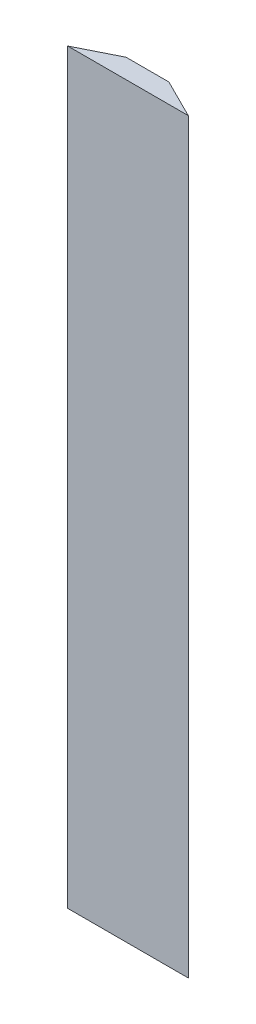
ISO-10303-21;
HEADER;
FILE_DESCRIPTION(('STEP AP214'),'2;1');
FILE_NAME('part.step','',(''),(''),'','','');
FILE_SCHEMA(('AUTOMOTIVE_DESIGN { 1 0 10303 214 1 1 1 1 }'));
ENDSEC;
DATA;
#1=APPLICATION_CONTEXT('core data for automotive mechanical design processes');
#2=APPLICATION_PROTOCOL_DEFINITION('international standard','automotive_design',2000,#1);
#3=PRODUCT_CONTEXT('',#1,'mechanical');
#4=PRODUCT('Part','Part','',(#3));
#5=PRODUCT_RELATED_PRODUCT_CATEGORY('part','',(#4));
#6=PRODUCT_DEFINITION_FORMATION('','',#4);
#7=PRODUCT_DEFINITION_CONTEXT('part definition',#1,'design');
#8=PRODUCT_DEFINITION('design','',#6,#7);
#9=PRODUCT_DEFINITION_SHAPE('','',#8);
#10=(LENGTH_UNIT() NAMED_UNIT(*) SI_UNIT(.MILLI.,.METRE.));
#11=(NAMED_UNIT(*) PLANE_ANGLE_UNIT() SI_UNIT($,.RADIAN.));
#12=(NAMED_UNIT(*) SI_UNIT($,.STERADIAN.) SOLID_ANGLE_UNIT());
#13=UNCERTAINTY_MEASURE_WITH_UNIT(LENGTH_MEASURE(1.E-05),#10,'distance_accuracy_value','');
#14=(GEOMETRIC_REPRESENTATION_CONTEXT(3) GLOBAL_UNCERTAINTY_ASSIGNED_CONTEXT((#13)) GLOBAL_UNIT_ASSIGNED_CONTEXT((#10,
#11,#12)) REPRESENTATION_CONTEXT('',''));
#15=CARTESIAN_POINT('',(0.,0.,0.));
#16=DIRECTION('',(0.,0.,1.));
#17=DIRECTION('',(1.,0.,0.));
#18=AXIS2_PLACEMENT_3D('',#15,#16,#17);
#19=CARTESIAN_POINT('',(98.425,1219.2,0.));
#20=DIRECTION('',(0.,0.,-1.));
#21=DIRECTION('',(-1.,0.,0.));
#22=AXIS2_PLACEMENT_3D('',#19,#20,#21);
#23=PLANE('',#22);
#24=DIRECTION('',(1.,0.,0.));
#25=VECTOR('',#24,1.);
#26=CARTESIAN_POINT('',(98.425,0.,0.));
#27=LINE('',#26,#25);
#28=CARTESIAN_POINT('',(-98.425,0.,0.));
#29=VERTEX_POINT('',#28);
#30=CARTESIAN_POINT('',(98.425,0.,0.));
#31=VERTEX_POINT('',#30);
#32=EDGE_CURVE('E102',#29,#31,#27,.T.);
#33=ORIENTED_EDGE('',*,*,#32,.T.);
#34=DIRECTION('',(0.,-1.,0.));
#35=VECTOR('',#34,1.);
#36=CARTESIAN_POINT('',(98.425,1219.2,0.));
#37=LINE('',#36,#35);
#38=CARTESIAN_POINT('',(98.425,1219.2,0.));
#39=VERTEX_POINT('',#38);
#40=EDGE_CURVE('E11',#39,#31,#37,.T.);
#41=ORIENTED_EDGE('',*,*,#40,.F.);
#42=DIRECTION('',(1.,0.,0.));
#43=VECTOR('',#42,1.);
#44=CARTESIAN_POINT('',(98.425,1219.2,0.));
#45=LINE('',#44,#43);
#46=CARTESIAN_POINT('',(-98.425,1219.2,0.));
#47=VERTEX_POINT('',#46);
#48=EDGE_CURVE('E89',#47,#39,#45,.T.);
#49=ORIENTED_EDGE('',*,*,#48,.F.);
#50=DIRECTION('',(0.,-1.,0.));
#51=VECTOR('',#50,1.);
#52=CARTESIAN_POINT('',(-98.425,1219.2,0.));
#53=LINE('',#52,#51);
#54=EDGE_CURVE('E98',#47,#29,#53,.T.);
#55=ORIENTED_EDGE('',*,*,#54,.T.);
#56=EDGE_LOOP('',(#33,#41,#49,#55));
#57=FACE_BOUND('',#56,.T.);
#58=ADVANCED_FACE('F38',(#57),#23,.F.);
#59=CARTESIAN_POINT('',(34.925,1219.2,-31.75));
#60=DIRECTION('',(-0.447213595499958,0.,0.894427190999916));
#61=DIRECTION('',(0.894427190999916,0.,0.447213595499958));
#62=AXIS2_PLACEMENT_3D('',#59,#60,#61);
#63=PLANE('',#62);
#64=DIRECTION('',(-0.894427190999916,0.,-0.447213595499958));
#65=VECTOR('',#64,1.);
#66=CARTESIAN_POINT('',(34.925,0.,-31.75));
#67=LINE('',#66,#65);
#68=CARTESIAN_POINT('',(34.925,0.,-31.75));
#69=VERTEX_POINT('',#68);
#70=EDGE_CURVE('E93',#31,#69,#67,.T.);
#71=ORIENTED_EDGE('',*,*,#70,.T.);
#72=DIRECTION('',(0.,-1.,0.));
#73=VECTOR('',#72,1.);
#74=CARTESIAN_POINT('',(34.925,1219.2,-31.75));
#75=LINE('',#74,#73);
#76=CARTESIAN_POINT('',(34.925,1219.2,-31.75));
#77=VERTEX_POINT('',#76);
#78=EDGE_CURVE('E46',#77,#69,#75,.T.);
#79=ORIENTED_EDGE('',*,*,#78,.F.);
#80=DIRECTION('',(-0.894427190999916,0.,-0.447213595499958));
#81=VECTOR('',#80,1.);
#82=CARTESIAN_POINT('',(34.925,1219.2,-31.75));
#83=LINE('',#82,#81);
#84=EDGE_CURVE('E84',#39,#77,#83,.T.);
#85=ORIENTED_EDGE('',*,*,#84,.F.);
#86=ORIENTED_EDGE('',*,*,#40,.T.);
#87=EDGE_LOOP('',(#71,#79,#85,#86));
#88=FACE_BOUND('',#87,.T.);
#89=ADVANCED_FACE('F92',(#88),#63,.F.);
#90=CARTESIAN_POINT('',(-34.925,1219.2,-31.75));
#91=DIRECTION('',(0.,0.,1.));
#92=DIRECTION('',(1.,0.,0.));
#93=AXIS2_PLACEMENT_3D('',#90,#91,#92);
#94=PLANE('',#93);
#95=DIRECTION('',(-1.,0.,0.));
#96=VECTOR('',#95,1.);
#97=CARTESIAN_POINT('',(-34.925,0.,-31.75));
#98=LINE('',#97,#96);
#99=CARTESIAN_POINT('',(-34.925,0.,-31.75));
#100=VERTEX_POINT('',#99);
#101=EDGE_CURVE('E71',#69,#100,#98,.T.);
#102=ORIENTED_EDGE('',*,*,#101,.T.);
#103=DIRECTION('',(0.,-1.,0.));
#104=VECTOR('',#103,1.);
#105=CARTESIAN_POINT('',(-34.925,1219.2,-31.75));
#106=LINE('',#105,#104);
#107=CARTESIAN_POINT('',(-34.925,1219.2,-31.75));
#108=VERTEX_POINT('',#107);
#109=EDGE_CURVE('E95',#108,#100,#106,.T.);
#110=ORIENTED_EDGE('',*,*,#109,.F.);
#111=DIRECTION('',(-1.,0.,0.));
#112=VECTOR('',#111,1.);
#113=CARTESIAN_POINT('',(-34.925,1219.2,-31.75));
#114=LINE('',#113,#112);
#115=EDGE_CURVE('E87',#77,#108,#114,.T.);
#116=ORIENTED_EDGE('',*,*,#115,.F.);
#117=ORIENTED_EDGE('',*,*,#78,.T.);
#118=EDGE_LOOP('',(#102,#110,#116,#117));
#119=FACE_BOUND('',#118,.T.);
#120=ADVANCED_FACE('F96',(#119),#94,.F.);
#121=CARTESIAN_POINT('',(-98.425,1219.2,0.));
#122=DIRECTION('',(0.447213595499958,0.,0.894427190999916));
#123=DIRECTION('',(0.894427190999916,0.,-0.447213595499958));
#124=AXIS2_PLACEMENT_3D('',#121,#122,#123);
#125=PLANE('',#124);
#126=DIRECTION('',(-0.894427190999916,0.,0.447213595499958));
#127=VECTOR('',#126,1.);
#128=CARTESIAN_POINT('',(-98.425,0.,0.));
#129=LINE('',#128,#127);
#130=EDGE_CURVE('E77',#100,#29,#129,.T.);
#131=ORIENTED_EDGE('',*,*,#130,.T.);
#132=ORIENTED_EDGE('',*,*,#54,.F.);
#133=DIRECTION('',(-0.894427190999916,0.,0.447213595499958));
#134=VECTOR('',#133,1.);
#135=CARTESIAN_POINT('',(-98.425,1219.2,0.));
#136=LINE('',#135,#134);
#137=EDGE_CURVE('E54',#108,#47,#136,.T.);
#138=ORIENTED_EDGE('',*,*,#137,.F.);
#139=ORIENTED_EDGE('',*,*,#109,.T.);
#140=EDGE_LOOP('',(#131,#132,#138,#139));
#141=FACE_BOUND('',#140,.T.);
#142=ADVANCED_FACE('F109',(#141),#125,.F.);
#143=CARTESIAN_POINT('',(0.,1219.2,0.));
#144=DIRECTION('',(0.,-1.,0.));
#145=DIRECTION('',(0.,0.,-1.));
#146=AXIS2_PLACEMENT_3D('',#143,#144,#145);
#147=PLANE('',#146);
#148=ORIENTED_EDGE('',*,*,#48,.T.);
#149=ORIENTED_EDGE('',*,*,#84,.T.);
#150=ORIENTED_EDGE('',*,*,#115,.T.);
#151=ORIENTED_EDGE('',*,*,#137,.T.);
#152=EDGE_LOOP('',(#148,#149,#150,#151));
#153=FACE_BOUND('',#152,.T.);
#154=ADVANCED_FACE('F85',(#153),#147,.F.);
#155=CARTESIAN_POINT('',(0.,0.,0.));
#156=DIRECTION('',(0.,-1.,0.));
#157=DIRECTION('',(0.,0.,-1.));
#158=AXIS2_PLACEMENT_3D('',#155,#156,#157);
#159=PLANE('',#158);
#160=ORIENTED_EDGE('',*,*,#32,.F.);
#161=ORIENTED_EDGE('',*,*,#130,.F.);
#162=ORIENTED_EDGE('',*,*,#101,.F.);
#163=ORIENTED_EDGE('',*,*,#70,.F.);
#164=EDGE_LOOP('',(#160,#161,#162,#163));
#165=FACE_BOUND('',#164,.T.);
#166=ADVANCED_FACE('F112',(#165),#159,.T.);
#167=CLOSED_SHELL('',(#58,#89,#120,#142,#154,#166));
#168=MANIFOLD_SOLID_BREP('B2',#167);
#169=ADVANCED_BREP_SHAPE_REPRESENTATION('',(#18,#168),#14);
#170=SHAPE_DEFINITION_REPRESENTATION(#9,#169);
ENDSEC;
END-ISO-10303-21;
